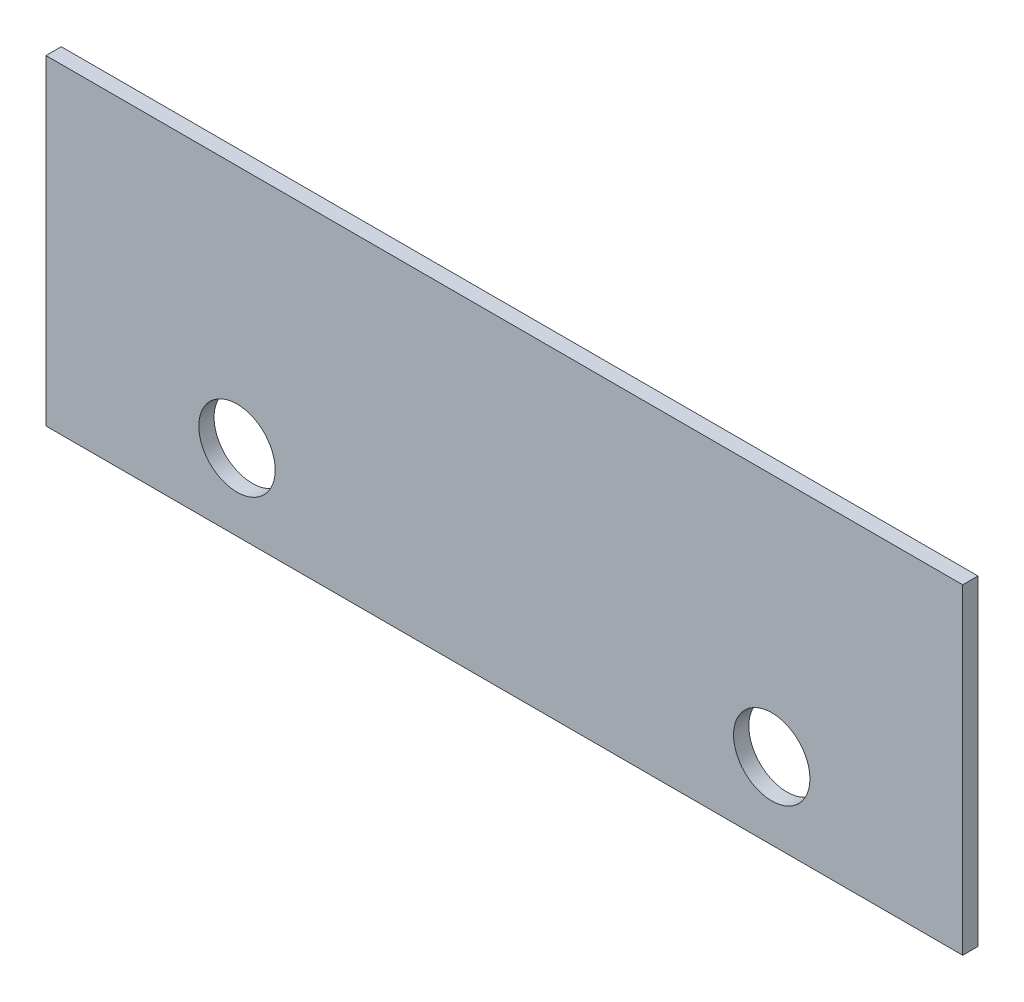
ISO-10303-21;
HEADER;
FILE_DESCRIPTION(('STEP AP214'),'2;1');
FILE_NAME('part.step','',(''),(''),'','','');
FILE_SCHEMA(('AUTOMOTIVE_DESIGN { 1 0 10303 214 1 1 1 1 }'));
ENDSEC;
DATA;
#1=APPLICATION_CONTEXT('core data for automotive mechanical design processes');
#2=APPLICATION_PROTOCOL_DEFINITION('international standard','automotive_design',2000,#1);
#3=PRODUCT_CONTEXT('',#1,'mechanical');
#4=PRODUCT('Part','Part','',(#3));
#5=PRODUCT_RELATED_PRODUCT_CATEGORY('part','',(#4));
#6=PRODUCT_DEFINITION_FORMATION('','',#4);
#7=PRODUCT_DEFINITION_CONTEXT('part definition',#1,'design');
#8=PRODUCT_DEFINITION('design','',#6,#7);
#9=PRODUCT_DEFINITION_SHAPE('','',#8);
#10=(LENGTH_UNIT() NAMED_UNIT(*) SI_UNIT(.MILLI.,.METRE.));
#11=(NAMED_UNIT(*) PLANE_ANGLE_UNIT() SI_UNIT($,.RADIAN.));
#12=(NAMED_UNIT(*) SI_UNIT($,.STERADIAN.) SOLID_ANGLE_UNIT());
#13=UNCERTAINTY_MEASURE_WITH_UNIT(LENGTH_MEASURE(1.E-05),#10,'distance_accuracy_value','');
#14=(GEOMETRIC_REPRESENTATION_CONTEXT(3) GLOBAL_UNCERTAINTY_ASSIGNED_CONTEXT((#13)) GLOBAL_UNIT_ASSIGNED_CONTEXT((#10,
#11,#12)) REPRESENTATION_CONTEXT('',''));
#15=CARTESIAN_POINT('',(0.,0.,0.));
#16=DIRECTION('',(0.,0.,1.));
#17=DIRECTION('',(1.,0.,0.));
#18=AXIS2_PLACEMENT_3D('',#15,#16,#17);
#19=CARTESIAN_POINT('',(-30.,10.5,-1.));
#20=DIRECTION('',(-1.,0.,0.));
#21=DIRECTION('',(0.,0.,1.));
#22=AXIS2_PLACEMENT_3D('',#19,#20,#21);
#23=PLANE('',#22);
#24=DIRECTION('',(0.,-1.,0.));
#25=VECTOR('',#24,1.);
#26=CARTESIAN_POINT('',(-30.,10.5,0.));
#27=LINE('',#26,#25);
#28=CARTESIAN_POINT('',(-30.,10.5,0.));
#29=VERTEX_POINT('',#28);
#30=CARTESIAN_POINT('',(-30.,-10.5,0.));
#31=VERTEX_POINT('',#30);
#32=EDGE_CURVE('E73',#29,#31,#27,.T.);
#33=ORIENTED_EDGE('',*,*,#32,.F.);
#34=DIRECTION('',(0.,0.,1.));
#35=VECTOR('',#34,1.);
#36=CARTESIAN_POINT('',(-30.,10.5,-1.));
#37=LINE('',#36,#35);
#38=CARTESIAN_POINT('',(-30.,10.5,-1.));
#39=VERTEX_POINT('',#38);
#40=EDGE_CURVE('E11',#39,#29,#37,.T.);
#41=ORIENTED_EDGE('',*,*,#40,.F.);
#42=DIRECTION('',(0.,-1.,0.));
#43=VECTOR('',#42,1.);
#44=CARTESIAN_POINT('',(-30.,10.5,-1.));
#45=LINE('',#44,#43);
#46=CARTESIAN_POINT('',(-30.,-10.5,-1.));
#47=VERTEX_POINT('',#46);
#48=EDGE_CURVE('E75',#39,#47,#45,.T.);
#49=ORIENTED_EDGE('',*,*,#48,.T.);
#50=DIRECTION('',(0.,0.,1.));
#51=VECTOR('',#50,1.);
#52=CARTESIAN_POINT('',(-30.,-10.5,-1.));
#53=LINE('',#52,#51);
#54=EDGE_CURVE('E36',#47,#31,#53,.T.);
#55=ORIENTED_EDGE('',*,*,#54,.T.);
#56=EDGE_LOOP('',(#33,#41,#49,#55));
#57=FACE_BOUND('',#56,.T.);
#58=ADVANCED_FACE('F33',(#57),#23,.T.);
#59=CARTESIAN_POINT('',(-30.,10.5,-1.));
#60=DIRECTION('',(0.,1.,0.));
#61=DIRECTION('',(-1.,0.,0.));
#62=AXIS2_PLACEMENT_3D('',#59,#60,#61);
#63=PLANE('',#62);
#64=DIRECTION('',(-1.,0.,0.));
#65=VECTOR('',#64,1.);
#66=CARTESIAN_POINT('',(-30.,10.5,0.));
#67=LINE('',#66,#65);
#68=CARTESIAN_POINT('',(30.,10.5,0.));
#69=VERTEX_POINT('',#68);
#70=EDGE_CURVE('E90',#69,#29,#67,.T.);
#71=ORIENTED_EDGE('',*,*,#70,.F.);
#72=DIRECTION('',(0.,0.,1.));
#73=VECTOR('',#72,1.);
#74=CARTESIAN_POINT('',(30.,10.5,-1.));
#75=LINE('',#74,#73);
#76=CARTESIAN_POINT('',(30.,10.5,-1.));
#77=VERTEX_POINT('',#76);
#78=EDGE_CURVE('E41',#77,#69,#75,.T.);
#79=ORIENTED_EDGE('',*,*,#78,.F.);
#80=DIRECTION('',(-1.,0.,0.));
#81=VECTOR('',#80,1.);
#82=CARTESIAN_POINT('',(-30.,10.5,-1.));
#83=LINE('',#82,#81);
#84=EDGE_CURVE('E80',#77,#39,#83,.T.);
#85=ORIENTED_EDGE('',*,*,#84,.T.);
#86=ORIENTED_EDGE('',*,*,#40,.T.);
#87=EDGE_LOOP('',(#71,#79,#85,#86));
#88=FACE_BOUND('',#87,.T.);
#89=ADVANCED_FACE('F110',(#88),#63,.T.);
#90=CARTESIAN_POINT('',(30.,10.5,-1.));
#91=DIRECTION('',(1.,0.,0.));
#92=DIRECTION('',(0.,1.,0.));
#93=AXIS2_PLACEMENT_3D('',#90,#91,#92);
#94=PLANE('',#93);
#95=DIRECTION('',(0.,1.,0.));
#96=VECTOR('',#95,1.);
#97=CARTESIAN_POINT('',(30.,10.5,0.));
#98=LINE('',#97,#96);
#99=CARTESIAN_POINT('',(30.,-10.5,0.));
#100=VERTEX_POINT('',#99);
#101=EDGE_CURVE('E87',#100,#69,#98,.T.);
#102=ORIENTED_EDGE('',*,*,#101,.F.);
#103=DIRECTION('',(0.,0.,1.));
#104=VECTOR('',#103,1.);
#105=CARTESIAN_POINT('',(30.,-10.5,-1.));
#106=LINE('',#105,#104);
#107=CARTESIAN_POINT('',(30.,-10.5,-1.));
#108=VERTEX_POINT('',#107);
#109=EDGE_CURVE('E79',#108,#100,#106,.T.);
#110=ORIENTED_EDGE('',*,*,#109,.F.);
#111=DIRECTION('',(0.,1.,0.));
#112=VECTOR('',#111,1.);
#113=CARTESIAN_POINT('',(30.,10.5,-1.));
#114=LINE('',#113,#112);
#115=EDGE_CURVE('E103',#108,#77,#114,.T.);
#116=ORIENTED_EDGE('',*,*,#115,.T.);
#117=ORIENTED_EDGE('',*,*,#78,.T.);
#118=EDGE_LOOP('',(#102,#110,#116,#117));
#119=FACE_BOUND('',#118,.T.);
#120=ADVANCED_FACE('F107',(#119),#94,.T.);
#121=CARTESIAN_POINT('',(-30.,-10.5,-1.));
#122=DIRECTION('',(0.,-1.,0.));
#123=DIRECTION('',(1.,0.,0.));
#124=AXIS2_PLACEMENT_3D('',#121,#122,#123);
#125=PLANE('',#124);
#126=DIRECTION('',(1.,0.,0.));
#127=VECTOR('',#126,1.);
#128=CARTESIAN_POINT('',(-30.,-10.5,0.));
#129=LINE('',#128,#127);
#130=EDGE_CURVE('E82',#31,#100,#129,.T.);
#131=ORIENTED_EDGE('',*,*,#130,.F.);
#132=ORIENTED_EDGE('',*,*,#54,.F.);
#133=DIRECTION('',(1.,0.,0.));
#134=VECTOR('',#133,1.);
#135=CARTESIAN_POINT('',(-30.,-10.5,-1.));
#136=LINE('',#135,#134);
#137=EDGE_CURVE('E101',#47,#108,#136,.T.);
#138=ORIENTED_EDGE('',*,*,#137,.T.);
#139=ORIENTED_EDGE('',*,*,#109,.T.);
#140=EDGE_LOOP('',(#131,#132,#138,#139));
#141=FACE_BOUND('',#140,.T.);
#142=ADVANCED_FACE('F83',(#141),#125,.T.);
#143=CARTESIAN_POINT('',(-30.,-10.5,-1.));
#144=DIRECTION('',(0.,0.,1.));
#145=DIRECTION('',(1.,0.,0.));
#146=AXIS2_PLACEMENT_3D('',#143,#144,#145);
#147=PLANE('',#146);
#148=CARTESIAN_POINT('',(17.5,-5.5,-1.));
#149=DIRECTION('',(0.,0.,1.));
#150=DIRECTION('',(1.,0.,0.));
#151=AXIS2_PLACEMENT_3D('',#148,#149,#150);
#152=CIRCLE('',#151,2.5);
#153=CARTESIAN_POINT('',(20.,-5.5,-1.));
#154=VERTEX_POINT('',#153);
#155=EDGE_CURVE('E175',#154,#154,#152,.T.);
#156=ORIENTED_EDGE('',*,*,#155,.T.);
#157=EDGE_LOOP('',(#156));
#158=FACE_BOUND('',#157,.T.);
#159=CARTESIAN_POINT('',(-17.5,-5.5,-1.));
#160=DIRECTION('',(0.,0.,1.));
#161=DIRECTION('',(1.,0.,0.));
#162=AXIS2_PLACEMENT_3D('',#159,#160,#161);
#163=CIRCLE('',#162,2.5);
#164=CARTESIAN_POINT('',(-15.,-5.5,-1.));
#165=VERTEX_POINT('',#164);
#166=EDGE_CURVE('E91',#165,#165,#163,.T.);
#167=ORIENTED_EDGE('',*,*,#166,.T.);
#168=EDGE_LOOP('',(#167));
#169=FACE_BOUND('',#168,.T.);
#170=ORIENTED_EDGE('',*,*,#48,.F.);
#171=ORIENTED_EDGE('',*,*,#84,.F.);
#172=ORIENTED_EDGE('',*,*,#115,.F.);
#173=ORIENTED_EDGE('',*,*,#137,.F.);
#174=EDGE_LOOP('',(#170,#171,#172,#173));
#175=FACE_BOUND('',#174,.T.);
#176=ADVANCED_FACE('F112',(#158,#169,#175),#147,.F.);
#177=CARTESIAN_POINT('',(-30.,-10.5,0.));
#178=DIRECTION('',(0.,0.,1.));
#179=DIRECTION('',(1.,0.,0.));
#180=AXIS2_PLACEMENT_3D('',#177,#178,#179);
#181=PLANE('',#180);
#182=CARTESIAN_POINT('',(17.5,-5.5,0.));
#183=DIRECTION('',(0.,0.,1.));
#184=DIRECTION('',(1.,0.,0.));
#185=AXIS2_PLACEMENT_3D('',#182,#183,#184);
#186=CIRCLE('',#185,2.5);
#187=CARTESIAN_POINT('',(20.,-5.5,0.));
#188=VERTEX_POINT('',#187);
#189=EDGE_CURVE('E178',#188,#188,#186,.T.);
#190=ORIENTED_EDGE('',*,*,#189,.F.);
#191=EDGE_LOOP('',(#190));
#192=FACE_BOUND('',#191,.T.);
#193=CARTESIAN_POINT('',(-17.5,-5.5,0.));
#194=DIRECTION('',(0.,0.,1.));
#195=DIRECTION('',(1.,0.,0.));
#196=AXIS2_PLACEMENT_3D('',#193,#194,#195);
#197=CIRCLE('',#196,2.5);
#198=CARTESIAN_POINT('',(-15.,-5.5,0.));
#199=VERTEX_POINT('',#198);
#200=EDGE_CURVE('E94',#199,#199,#197,.T.);
#201=ORIENTED_EDGE('',*,*,#200,.F.);
#202=EDGE_LOOP('',(#201));
#203=FACE_BOUND('',#202,.T.);
#204=ORIENTED_EDGE('',*,*,#32,.T.);
#205=ORIENTED_EDGE('',*,*,#130,.T.);
#206=ORIENTED_EDGE('',*,*,#101,.T.);
#207=ORIENTED_EDGE('',*,*,#70,.T.);
#208=EDGE_LOOP('',(#204,#205,#206,#207));
#209=FACE_BOUND('',#208,.T.);
#210=ADVANCED_FACE('F89',(#192,#203,#209),#181,.T.);
#211=CARTESIAN_POINT('',(-17.5,-5.5,-1.));
#212=DIRECTION('',(0.,0.,1.));
#213=DIRECTION('',(1.,0.,0.));
#214=AXIS2_PLACEMENT_3D('',#211,#212,#213);
#215=CYLINDRICAL_SURFACE('',#214,2.5);
#216=ORIENTED_EDGE('',*,*,#166,.F.);
#217=EDGE_LOOP('',(#216));
#218=FACE_BOUND('',#217,.T.);
#219=ORIENTED_EDGE('',*,*,#200,.T.);
#220=EDGE_LOOP('',(#219));
#221=FACE_BOUND('',#220,.T.);
#222=ADVANCED_FACE('F120',(#218,#221),#215,.F.);
#223=CARTESIAN_POINT('',(17.5,-5.5,-1.));
#224=DIRECTION('',(0.,0.,1.));
#225=DIRECTION('',(1.,0.,0.));
#226=AXIS2_PLACEMENT_3D('',#223,#224,#225);
#227=CYLINDRICAL_SURFACE('',#226,2.5);
#228=ORIENTED_EDGE('',*,*,#155,.F.);
#229=EDGE_LOOP('',(#228));
#230=FACE_BOUND('',#229,.T.);
#231=ORIENTED_EDGE('',*,*,#189,.T.);
#232=EDGE_LOOP('',(#231));
#233=FACE_BOUND('',#232,.T.);
#234=ADVANCED_FACE('F159',(#230,#233),#227,.F.);
#235=CLOSED_SHELL('',(#58,#89,#120,#142,#176,#210,#222,#234));
#236=MANIFOLD_SOLID_BREP('B2',#235);
#237=ADVANCED_BREP_SHAPE_REPRESENTATION('',(#18,#236),#14);
#238=SHAPE_DEFINITION_REPRESENTATION(#9,#237);
ENDSEC;
END-ISO-10303-21;
